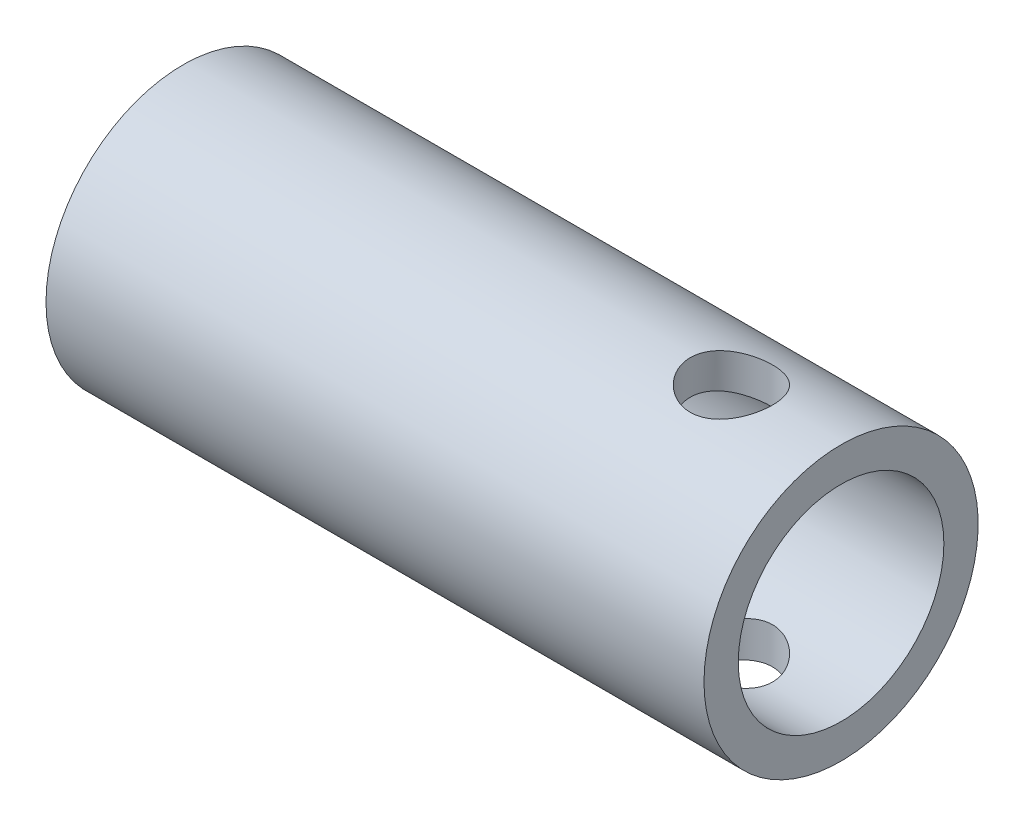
ISO-10303-21;
HEADER;
FILE_DESCRIPTION(('STEP AP214'),'2;1');
FILE_NAME('part.step','',(''),(''),'','','');
FILE_SCHEMA(('AUTOMOTIVE_DESIGN { 1 0 10303 214 1 1 1 1 }'));
ENDSEC;
DATA;
#1=APPLICATION_CONTEXT('core data for automotive mechanical design processes');
#2=APPLICATION_PROTOCOL_DEFINITION('international standard','automotive_design',2000,#1);
#3=PRODUCT_CONTEXT('',#1,'mechanical');
#4=PRODUCT('Part','Part','',(#3));
#5=PRODUCT_RELATED_PRODUCT_CATEGORY('part','',(#4));
#6=PRODUCT_DEFINITION_FORMATION('','',#4);
#7=PRODUCT_DEFINITION_CONTEXT('part definition',#1,'design');
#8=PRODUCT_DEFINITION('design','',#6,#7);
#9=PRODUCT_DEFINITION_SHAPE('','',#8);
#10=(LENGTH_UNIT() NAMED_UNIT(*) SI_UNIT(.MILLI.,.METRE.));
#11=(NAMED_UNIT(*) PLANE_ANGLE_UNIT() SI_UNIT($,.RADIAN.));
#12=(NAMED_UNIT(*) SI_UNIT($,.STERADIAN.) SOLID_ANGLE_UNIT());
#13=UNCERTAINTY_MEASURE_WITH_UNIT(LENGTH_MEASURE(1.E-05),#10,'distance_accuracy_value','');
#14=(GEOMETRIC_REPRESENTATION_CONTEXT(3) GLOBAL_UNCERTAINTY_ASSIGNED_CONTEXT((#13)) GLOBAL_UNIT_ASSIGNED_CONTEXT((#10,
#11,#12)) REPRESENTATION_CONTEXT('',''));
#15=CARTESIAN_POINT('',(0.,0.,0.));
#16=DIRECTION('',(0.,0.,1.));
#17=DIRECTION('',(1.,0.,0.));
#18=AXIS2_PLACEMENT_3D('',#15,#16,#17);
#19=CARTESIAN_POINT('',(-25.4,0.,31.75));
#20=DIRECTION('',(0.,1.,0.));
#21=DIRECTION('',(0.,0.,1.));
#22=AXIS2_PLACEMENT_3D('',#19,#20,#21);
#23=CYLINDRICAL_SURFACE('',#22,9.525);
#24=CARTESIAN_POINT('',(-25.4,9.92548325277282,41.275));
#25=CARTESIAN_POINT('',(-25.1447840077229,9.92548128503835,41.2749980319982));
#26=CARTESIAN_POINT('',(-24.8894900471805,9.92099147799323,41.2647285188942));
#27=CARTESIAN_POINT('',(-24.3807474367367,9.90317655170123,41.2237502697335));
#28=CARTESIAN_POINT('',(-24.1273000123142,9.88984602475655,41.1930290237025));
#29=CARTESIAN_POINT('',(-23.6237016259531,9.85475984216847,41.1113882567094));
#30=CARTESIAN_POINT('',(-23.3735590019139,9.8329859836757,41.0604250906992));
#31=CARTESIAN_POINT('',(-22.8789020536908,9.78172906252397,40.9388286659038));
#32=CARTESIAN_POINT('',(-22.6343881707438,9.75224539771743,40.8681938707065));
#33=CARTESIAN_POINT('',(-22.153550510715,9.68662654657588,40.7082443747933));
#34=CARTESIAN_POINT('',(-21.917198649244,9.65051759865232,40.6190031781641));
#35=CARTESIAN_POINT('',(-21.4531071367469,9.5726432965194,40.4224375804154));
#36=CARTESIAN_POINT('',(-21.2253677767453,9.5308777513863,40.3151125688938));
#37=CARTESIAN_POINT('',(-20.7798774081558,9.44288462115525,40.0832538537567));
#38=CARTESIAN_POINT('',(-20.5621216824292,9.39665917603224,39.9587283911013));
#39=CARTESIAN_POINT('',(-20.1375366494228,9.30094103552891,39.6932249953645));
#40=CARTESIAN_POINT('',(-19.9307113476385,9.25144715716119,39.552241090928));
#41=CARTESIAN_POINT('',(-19.5187098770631,9.14784706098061,39.2470081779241));
#42=CARTESIAN_POINT('',(-19.3141719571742,9.0936346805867,39.0819331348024));
#43=CARTESIAN_POINT('',(-18.9195353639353,8.98445610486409,38.7355662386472));
#44=CARTESIAN_POINT('',(-18.7294371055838,8.92948988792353,38.5542739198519));
#45=CARTESIAN_POINT('',(-18.3646662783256,8.82021254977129,38.1764062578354));
#46=CARTESIAN_POINT('',(-18.1900017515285,8.76590178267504,37.979823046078));
#47=CARTESIAN_POINT('',(-17.8573307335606,8.65938363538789,37.5726165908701));
#48=CARTESIAN_POINT('',(-17.6993185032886,8.60717553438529,37.3619982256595));
#49=CARTESIAN_POINT('',(-17.39496675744,8.50416670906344,36.919148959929));
#50=CARTESIAN_POINT('',(-17.2493457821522,8.45350553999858,36.6863907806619));
#51=CARTESIAN_POINT('',(-16.9784051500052,8.35733550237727,36.2084514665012));
#52=CARTESIAN_POINT('',(-16.8530771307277,8.31182451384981,35.9632755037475));
#53=CARTESIAN_POINT('',(-16.6237804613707,8.22724078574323,35.4620785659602));
#54=CARTESIAN_POINT('',(-16.5198098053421,8.18816744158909,35.2060586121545));
#55=CARTESIAN_POINT('',(-16.3342536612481,8.11760872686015,34.6850181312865));
#56=CARTESIAN_POINT('',(-16.2526667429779,8.08612287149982,34.4199981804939));
#57=CARTESIAN_POINT('',(-16.1161490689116,8.03300899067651,33.8960301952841));
#58=CARTESIAN_POINT('',(-16.0601191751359,8.01097756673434,33.6374092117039));
#59=CARTESIAN_POINT('',(-15.9697212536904,7.97526636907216,33.1158368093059));
#60=CARTESIAN_POINT('',(-15.9353525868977,7.96158634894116,32.8528855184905));
#61=CARTESIAN_POINT('',(-15.888666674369,7.94297300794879,32.3248078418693));
#62=CARTESIAN_POINT('',(-15.8763424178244,7.93803690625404,32.0596821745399));
#63=CARTESIAN_POINT('',(-15.8738654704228,7.93704624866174,31.5293150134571));
#64=CARTESIAN_POINT('',(-15.8837120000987,7.94099138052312,31.2640735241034));
#65=CARTESIAN_POINT('',(-15.9242841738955,7.95717743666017,30.7504933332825));
#66=CARTESIAN_POINT('',(-15.9538041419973,7.96893921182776,30.5020431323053));
#67=CARTESIAN_POINT('',(-16.0321890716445,7.99996595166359,30.0087013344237));
#68=CARTESIAN_POINT('',(-16.0810531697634,8.01923058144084,29.7638095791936));
#69=CARTESIAN_POINT('',(-16.1976619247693,8.06477929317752,29.2792289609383));
#70=CARTESIAN_POINT('',(-16.2654072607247,8.09106362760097,29.0395402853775));
#71=CARTESIAN_POINT('',(-16.4191707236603,8.15000452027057,28.5669051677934));
#72=CARTESIAN_POINT('',(-16.5051893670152,8.18266125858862,28.3339589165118));
#73=CARTESIAN_POINT('',(-16.6961924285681,8.25408889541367,27.8728147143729));
#74=CARTESIAN_POINT('',(-16.801439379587,8.29294334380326,27.6447385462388));
#75=CARTESIAN_POINT('',(-17.0292345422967,8.37548447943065,27.1982138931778));
#76=CARTESIAN_POINT('',(-17.151788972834,8.41917290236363,26.9797689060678));
#77=CARTESIAN_POINT('',(-17.41331549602,8.51034333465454,26.5537539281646));
#78=CARTESIAN_POINT('',(-17.5522888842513,8.55782564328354,26.3461847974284));
#79=CARTESIAN_POINT('',(-17.8457656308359,8.65548026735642,25.942991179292));
#80=CARTESIAN_POINT('',(-18.0002701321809,8.70565278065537,25.7473675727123));
#81=CARTESIAN_POINT('',(-18.3345450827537,8.81087633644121,25.3566171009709));
#82=CARTESIAN_POINT('',(-18.5153084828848,8.86603136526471,25.1623667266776));
#83=CARTESIAN_POINT('',(-18.89235845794,8.97662848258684,24.7896476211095));
#84=CARTESIAN_POINT('',(-19.0886456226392,9.03207058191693,24.611179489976));
#85=CARTESIAN_POINT('',(-19.495691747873,9.14177208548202,24.2710201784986));
#86=CARTESIAN_POINT('',(-19.706455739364,9.19603106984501,24.1093348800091));
#87=CARTESIAN_POINT('',(-20.1412043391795,9.3018370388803,23.8038517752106));
#88=CARTESIAN_POINT('',(-20.3651883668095,9.35338414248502,23.660053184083));
#89=CARTESIAN_POINT('',(-20.8317013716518,9.45368787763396,23.3875053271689));
#90=CARTESIAN_POINT('',(-21.074577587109,9.50232247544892,23.2593043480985));
#91=CARTESIAN_POINT('',(-21.5713319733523,9.59354127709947,23.0240377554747));
#92=CARTESIAN_POINT('',(-21.8252053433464,9.63612808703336,22.9169630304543));
#93=CARTESIAN_POINT('',(-22.3422252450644,9.71379714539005,22.7249429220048));
#94=CARTESIAN_POINT('',(-22.6053689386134,9.7488816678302,22.6399908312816));
#95=CARTESIAN_POINT('',(-23.1390023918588,9.81027734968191,22.4931063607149));
#96=CARTESIAN_POINT('',(-23.4094915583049,9.83658921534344,22.4311721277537));
#97=CARTESIAN_POINT('',(-23.9389015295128,9.87812284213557,22.3341222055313));
#98=CARTESIAN_POINT('',(-24.1975194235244,9.89392396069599,22.2975991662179));
#99=CARTESIAN_POINT('',(-24.7172759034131,9.91635045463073,22.2459110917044));
#100=CARTESIAN_POINT('',(-24.9784143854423,9.92297620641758,22.230745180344));
#101=CARTESIAN_POINT('',(-25.5010523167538,9.92681340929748,22.2219516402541));
#102=CARTESIAN_POINT('',(-25.7625516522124,9.92402735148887,22.2283183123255));
#103=CARTESIAN_POINT('',(-26.2838718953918,9.90914660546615,22.2625015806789));
#104=CARTESIAN_POINT('',(-26.5436928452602,9.89705215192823,22.2903176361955));
#105=CARTESIAN_POINT('',(-27.044829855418,9.86493497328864,22.3648724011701));
#106=CARTESIAN_POINT('',(-27.2863537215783,9.84540579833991,22.4104365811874));
#107=CARTESIAN_POINT('',(-27.7645776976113,9.79905244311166,22.5199085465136));
#108=CARTESIAN_POINT('',(-28.0012761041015,9.77222573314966,22.583822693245));
#109=CARTESIAN_POINT('',(-28.4682386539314,9.71207794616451,22.729393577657));
#110=CARTESIAN_POINT('',(-28.6985041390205,9.67875823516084,22.8110465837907));
#111=CARTESIAN_POINT('',(-29.1514201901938,9.60654332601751,22.9914658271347));
#112=CARTESIAN_POINT('',(-29.3740677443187,9.56764595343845,23.090238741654));
#113=CARTESIAN_POINT('',(-29.8192377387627,9.48366871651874,23.3084449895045));
#114=CARTESIAN_POINT('',(-30.0413967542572,9.43840341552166,23.4285482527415));
#115=CARTESIAN_POINT('',(-30.4750071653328,9.34418800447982,23.6856653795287));
#116=CARTESIAN_POINT('',(-30.6864537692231,9.29523626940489,23.8226867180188));
#117=CARTESIAN_POINT('',(-31.0974889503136,9.19493010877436,24.1127541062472));
#118=CARTESIAN_POINT('',(-31.2970759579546,9.14357536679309,24.2658022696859));
#119=CARTESIAN_POINT('',(-31.6833649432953,9.03974706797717,24.5870355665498));
#120=CARTESIAN_POINT('',(-31.8700664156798,8.98727346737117,24.7552212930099));
#121=CARTESIAN_POINT('',(-32.2429674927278,8.87858543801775,25.118848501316));
#122=CARTESIAN_POINT('',(-32.4281031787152,8.82238216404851,25.3153862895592));
#123=CARTESIAN_POINT('',(-32.7811792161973,8.711700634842,25.7236714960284));
#124=CARTESIAN_POINT('',(-32.9491254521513,8.65722179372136,25.9354136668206));
#125=CARTESIAN_POINT('',(-33.2668335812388,8.55141920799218,26.3730400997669));
#126=CARTESIAN_POINT('',(-33.416586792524,8.50009697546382,26.5989310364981));
#127=CARTESIAN_POINT('',(-33.6966222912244,8.40206063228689,27.0632994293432));
#128=CARTESIAN_POINT('',(-33.8269129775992,8.35534453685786,27.3017713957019));
#129=CARTESIAN_POINT('',(-34.0670073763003,8.267792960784,27.789876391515));
#130=CARTESIAN_POINT('',(-34.1768101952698,8.22695773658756,28.0395099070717));
#131=CARTESIAN_POINT('',(-34.374890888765,8.15233538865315,28.5482105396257));
#132=CARTESIAN_POINT('',(-34.4631685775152,8.11854832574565,28.8072777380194));
#133=CARTESIAN_POINT('',(-34.6172497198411,8.05902762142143,29.3327962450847));
#134=CARTESIAN_POINT('',(-34.6830632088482,8.03329038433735,29.5992441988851));
#135=CARTESIAN_POINT('',(-34.7915299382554,7.99062559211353,30.1375031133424));
#136=CARTESIAN_POINT('',(-34.8341847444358,7.9736974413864,30.4093137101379));
#137=CARTESIAN_POINT('',(-34.8938221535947,7.94996846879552,30.9381584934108));
#138=CARTESIAN_POINT('',(-34.9122990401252,7.9425786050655,31.1949987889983));
#139=CARTESIAN_POINT('',(-34.9283888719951,7.93614546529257,31.7094310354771));
#140=CARTESIAN_POINT('',(-34.9260027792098,7.93710180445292,31.9670229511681));
#141=CARTESIAN_POINT('',(-34.9003952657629,7.94733406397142,32.4809630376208));
#142=CARTESIAN_POINT('',(-34.877176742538,7.95660882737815,32.7373113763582));
#143=CARTESIAN_POINT('',(-34.8101554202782,7.9832246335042,33.2468753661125));
#144=CARTESIAN_POINT('',(-34.7663526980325,8.00056564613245,33.5000910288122));
#145=CARTESIAN_POINT('',(-34.6602848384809,8.04219309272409,33.9937713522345));
#146=CARTESIAN_POINT('',(-34.5986337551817,8.06624769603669,34.2343880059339));
#147=CARTESIAN_POINT('',(-34.4569641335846,8.12091071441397,34.7094751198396));
#148=CARTESIAN_POINT('',(-34.3769391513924,8.15152142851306,34.9439433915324));
#149=CARTESIAN_POINT('',(-34.1992193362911,8.21855245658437,35.4051944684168));
#150=CARTESIAN_POINT('',(-34.1015260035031,8.25497227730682,35.6319779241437));
#151=CARTESIAN_POINT('',(-33.889217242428,8.33277155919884,36.0766057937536));
#152=CARTESIAN_POINT('',(-33.7746004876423,8.37415140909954,36.2944495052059));
#153=CARTESIAN_POINT('',(-33.5238360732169,8.46283852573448,36.7294262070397));
#154=CARTESIAN_POINT('',(-33.3869611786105,8.51032684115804,36.9461030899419));
#155=CARTESIAN_POINT('',(-33.0965957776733,8.60851228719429,37.3672470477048));
#156=CARTESIAN_POINT('',(-32.9431048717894,8.65920949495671,37.5717138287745));
#157=CARTESIAN_POINT('',(-32.6204105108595,8.76260139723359,37.9674353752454));
#158=CARTESIAN_POINT('',(-32.4512012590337,8.81529682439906,38.1586852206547));
#159=CARTESIAN_POINT('',(-32.0980925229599,8.9213859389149,38.5268910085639));
#160=CARTESIAN_POINT('',(-31.9141928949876,8.97477963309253,38.7038468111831));
#161=CARTESIAN_POINT('',(-31.5208142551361,9.0842542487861,39.0530583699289));
#162=CARTESIAN_POINT('',(-31.3104556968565,9.14029576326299,39.2243372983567));
#163=CARTESIAN_POINT('',(-30.8755805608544,9.25006062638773,39.5485366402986));
#164=CARTESIAN_POINT('',(-30.6510687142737,9.30378473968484,39.7014631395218));
#165=CARTESIAN_POINT('',(-30.1890448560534,9.40735497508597,39.9879969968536));
#166=CARTESIAN_POINT('',(-29.9515275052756,9.45719948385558,40.1215963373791));
#167=CARTESIAN_POINT('',(-29.465060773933,9.55141125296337,40.3683096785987));
#168=CARTESIAN_POINT('',(-29.2161129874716,9.59577927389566,40.4814265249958));
#169=CARTESIAN_POINT('',(-28.731221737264,9.67389160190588,40.6769626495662));
#170=CARTESIAN_POINT('',(-28.496116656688,9.70823201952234,40.761225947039));
#171=CARTESIAN_POINT('',(-28.019207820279,9.77014762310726,40.9112137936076));
#172=CARTESIAN_POINT('',(-27.7774048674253,9.79772361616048,40.9769405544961));
#173=CARTESIAN_POINT('',(-27.2892463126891,9.84520811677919,41.0891087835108));
#174=CARTESIAN_POINT('',(-27.04290301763,9.86513485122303,41.135596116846));
#175=CARTESIAN_POINT('',(-26.5468981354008,9.89676830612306,41.2090187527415));
#176=CARTESIAN_POINT('',(-26.2972385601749,9.90847979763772,41.2359654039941));
#177=CARTESIAN_POINT('',(-25.9392336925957,9.91908841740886,41.2603365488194));
#178=CARTESIAN_POINT('',(-25.8314832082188,9.92148455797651,41.2658334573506));
#179=CARTESIAN_POINT('',(-25.6158264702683,9.92468245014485,41.2731657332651));
#180=CARTESIAN_POINT('',(-25.5079202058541,9.92548408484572,41.275000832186));
#181=CARTESIAN_POINT('',(-25.4,9.92548325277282,41.275));
#182=B_SPLINE_CURVE_WITH_KNOTS('',3,(#24,#25,#26,#27,#28,#29,#30,#31,#32,#33,#34,#35,#36,#37,
#38,#39,#40,#41,#42,#43,#44,#45,#46,#47,#48,#49,#50,#51,#52,#53,#54,#55,#56,#57,#58,#59,#60,#61,
#62,#63,#64,#65,#66,#67,#68,#69,#70,#71,#72,#73,#74,#75,#76,#77,#78,#79,#80,#81,#82,#83,#84,#85,
#86,#87,#88,#89,#90,#91,#92,#93,#94,#95,#96,#97,#98,#99,#100,#101,#102,#103,#104,#105,#106,#107,
#108,#109,#110,#111,#112,#113,#114,#115,#116,#117,#118,#119,#120,#121,#122,#123,#124,#125,#126,
#127,#128,#129,#130,#131,#132,#133,#134,#135,#136,#137,#138,#139,#140,#141,#142,#143,#144,#145,
#146,#147,#148,#149,#150,#151,#152,#153,#154,#155,#156,#157,#158,#159,#160,#161,#162,#163,#164,
#165,#166,#167,#168,#169,#170,#171,#172,#173,#174,#175,#176,#177,#178,#179,#180,#181),
.UNSPECIFIED.,.T.,.F.,(4,2,2,2,2,2,2,2,2,2,2,2,2,2,2,2,2,2,2,2,2,2,2,2,2,2,2,2,2,2,2,2,2,2,2,2,
2,2,2,2,2,2,2,2,2,2,2,2,2,2,2,2,2,2,2,2,2,2,2,2,2,2,2,2,2,2,2,2,2,2,2,2,2,2,2,2,2,2,4),(0.,
0.765538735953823,1.53154616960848,2.29921429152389,3.06694238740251,3.83169318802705,
4.59646980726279,5.36088127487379,6.12557094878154,6.929800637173,7.73405343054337,
8.53872285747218,9.34311404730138,10.1796415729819,11.0158234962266,11.8519268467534,
12.687976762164,13.483557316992,14.2791143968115,15.0744184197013,15.8696944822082,
16.6202337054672,17.3707394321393,18.1212721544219,18.8718260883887,19.6335193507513,
20.3954870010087,21.1575148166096,21.9195987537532,22.7317355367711,23.54390318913,
24.3563545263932,25.1687702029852,26.0044298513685,26.839728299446,27.6747732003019,
28.5097508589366,29.293713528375,30.077644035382,30.8613670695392,31.645070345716,
32.3839052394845,33.1229965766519,33.8619325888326,34.6011574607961,35.3700412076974,
36.139265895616,36.9085921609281,37.6779485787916,38.5043576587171,39.3304828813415,
40.1570008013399,40.983161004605,41.8093572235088,42.6355605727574,43.4613943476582,
44.2871722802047,45.0590362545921,45.8308646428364,46.6025856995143,47.374303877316,
48.1221124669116,48.8701837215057,49.6181914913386,50.3662579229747,51.1473553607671,
51.9284715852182,52.7098770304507,53.4912901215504,54.3213033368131,55.151040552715,
55.9811209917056,56.8110860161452,57.5665556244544,58.32193505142,59.0755031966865,
59.8286333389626,60.1523240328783,60.4760384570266),.UNSPECIFIED.);
#183=CARTESIAN_POINT('',(-25.4,9.92548325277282,41.275));
#184=VERTEX_POINT('',#183);
#185=EDGE_CURVE('E73',#184,#184,#182,.T.);
#186=ORIENTED_EDGE('',*,*,#185,.T.);
#187=EDGE_LOOP('',(#186));
#188=FACE_BOUND('',#187,.T.);
#189=CARTESIAN_POINT('',(-34.925,0.,31.75));
#190=CARTESIAN_POINT('',(-34.9249994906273,3.27487291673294E-07,32.0112762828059));
#191=CARTESIAN_POINT('',(-34.9142407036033,0.0032328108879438,32.2725615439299));
#192=CARTESIAN_POINT('',(-34.8713024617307,0.0160744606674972,32.7932132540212));
#193=CARTESIAN_POINT('',(-34.8391220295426,0.0256839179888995,33.0525796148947));
#194=CARTESIAN_POINT('',(-34.7536208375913,0.0510184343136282,33.5675671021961));
#195=CARTESIAN_POINT('',(-34.7002946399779,0.0667450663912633,33.8231872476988));
#196=CARTESIAN_POINT('',(-34.5729711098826,0.103885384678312,34.3287964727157));
#197=CARTESIAN_POINT('',(-34.4989739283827,0.125299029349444,34.5787855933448));
#198=CARTESIAN_POINT('',(-34.3310728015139,0.173197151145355,35.0710042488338));
#199=CARTESIAN_POINT('',(-34.2372027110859,0.199672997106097,35.3132461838));
#200=CARTESIAN_POINT('',(-34.0301879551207,0.257030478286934,35.7889089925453));
#201=CARTESIAN_POINT('',(-33.9170361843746,0.287913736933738,36.022326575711));
#202=CARTESIAN_POINT('',(-33.6723403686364,0.353270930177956,36.4787475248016));
#203=CARTESIAN_POINT('',(-33.5407983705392,0.387744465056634,36.7017520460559));
#204=CARTESIAN_POINT('',(-33.2602281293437,0.459399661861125,37.1360258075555));
#205=CARTESIAN_POINT('',(-33.1111989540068,0.496581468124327,37.3472944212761));
#206=CARTESIAN_POINT('',(-32.7925724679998,0.573686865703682,37.7621256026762));
#207=CARTESIAN_POINT('',(-32.6225430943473,0.613656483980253,37.9653478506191));
#208=CARTESIAN_POINT('',(-32.2662394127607,0.694372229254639,38.3568480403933));
#209=CARTESIAN_POINT('',(-32.0799648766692,0.735118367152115,38.5451257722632));
#210=CARTESIAN_POINT('',(-31.6923165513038,0.816293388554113,38.905587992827));
#211=CARTESIAN_POINT('',(-31.4909400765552,0.856722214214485,39.0777696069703));
#212=CARTESIAN_POINT('',(-31.0743749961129,0.936145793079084,39.4048824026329));
#213=CARTESIAN_POINT('',(-30.8591867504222,0.975140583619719,39.5598140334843));
#214=CARTESIAN_POINT('',(-30.4112813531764,1.05146534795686,39.8547024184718));
#215=CARTESIAN_POINT('',(-30.1782766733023,1.08873721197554,39.9942379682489));
#216=CARTESIAN_POINT('',(-29.7008466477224,1.15950379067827,40.2530609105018));
#217=CARTESIAN_POINT('',(-29.4564257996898,1.19299997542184,40.3723561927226));
#218=CARTESIAN_POINT('',(-28.9577494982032,1.25519279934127,40.589798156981));
#219=CARTESIAN_POINT('',(-28.7034938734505,1.28388935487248,40.6879444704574));
#220=CARTESIAN_POINT('',(-28.1869816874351,1.33556044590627,40.8622247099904));
#221=CARTESIAN_POINT('',(-27.9247254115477,1.35853518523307,40.9383594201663));
#222=CARTESIAN_POINT('',(-27.4016099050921,1.39745147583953,41.0660953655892));
#223=CARTESIAN_POINT('',(-27.1409170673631,1.41357190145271,41.1183236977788));
#224=CARTESIAN_POINT('',(-26.6157565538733,1.43917408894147,41.200830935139));
#225=CARTESIAN_POINT('',(-26.3512889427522,1.44865596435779,41.2311102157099));
#226=CARTESIAN_POINT('',(-25.8206452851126,1.46067063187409,41.2694238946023));
#227=CARTESIAN_POINT('',(-25.5544696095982,1.46320488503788,41.2774629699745));
#228=CARTESIAN_POINT('',(-25.0224086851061,1.46124490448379,41.2712303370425));
#229=CARTESIAN_POINT('',(-24.7565234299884,1.45675082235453,41.2569591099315));
#230=CARTESIAN_POINT('',(-24.236715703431,1.44117170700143,41.2071703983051));
#231=CARTESIAN_POINT('',(-23.9827096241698,1.43033211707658,41.1724438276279));
#232=CARTESIAN_POINT('',(-23.4785526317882,1.40258727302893,41.0826976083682));
#233=CARTESIAN_POINT('',(-23.2284031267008,1.38567985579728,41.027670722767));
#234=CARTESIAN_POINT('',(-22.7338338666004,1.34630675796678,40.8978156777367));
#235=CARTESIAN_POINT('',(-22.4894123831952,1.3238427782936,40.8229935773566));
#236=CARTESIAN_POINT('',(-22.0077250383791,1.27399324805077,40.6541147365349));
#237=CARTESIAN_POINT('',(-21.770461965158,1.24660580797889,40.5600506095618));
#238=CARTESIAN_POINT('',(-21.3015831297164,1.18729248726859,40.352049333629));
#239=CARTESIAN_POINT('',(-21.0700840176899,1.1553112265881,40.2378651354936));
#240=CARTESIAN_POINT('',(-20.6173863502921,1.08796917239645,39.9912802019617));
#241=CARTESIAN_POINT('',(-20.3961924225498,1.05260688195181,39.858871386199));
#242=CARTESIAN_POINT('',(-19.9655378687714,0.979474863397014,39.5767812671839));
#243=CARTESIAN_POINT('',(-19.756077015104,0.941705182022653,39.427100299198));
#244=CARTESIAN_POINT('',(-19.3501072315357,0.864755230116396,39.1114226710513));
#245=CARTESIAN_POINT('',(-19.1535986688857,0.825574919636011,38.9454255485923));
#246=CARTESIAN_POINT('',(-18.7667243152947,0.745162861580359,38.59083236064));
#247=CARTESIAN_POINT('',(-18.5769630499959,0.703914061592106,38.4015800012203));
#248=CARTESIAN_POINT('',(-18.2140509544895,0.62214293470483,38.0077503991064));
#249=CARTESIAN_POINT('',(-18.0408943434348,0.581620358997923,37.8031785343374));
#250=CARTESIAN_POINT('',(-17.7122016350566,0.50238152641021,37.3798510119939));
#251=CARTESIAN_POINT('',(-17.5566736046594,0.463666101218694,37.1610889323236));
#252=CARTESIAN_POINT('',(-17.2644908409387,0.389141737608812,36.7109559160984));
#253=CARTESIAN_POINT('',(-17.1278286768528,0.353331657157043,36.4795899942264));
#254=CARTESIAN_POINT('',(-16.8734546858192,0.285357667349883,36.0040408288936));
#255=CARTESIAN_POINT('',(-16.7558810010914,0.253220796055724,35.7597797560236));
#256=CARTESIAN_POINT('',(-16.5418012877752,0.193796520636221,35.2616147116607));
#257=CARTESIAN_POINT('',(-16.4452954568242,0.166509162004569,35.0077106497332));
#258=CARTESIAN_POINT('',(-16.2742125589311,0.117577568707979,34.4921484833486));
#259=CARTESIAN_POINT('',(-16.1996305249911,0.0959320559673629,34.2304921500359));
#260=CARTESIAN_POINT('',(-16.0730550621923,0.0589112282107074,33.7013382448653));
#261=CARTESIAN_POINT('',(-16.0210608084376,0.0435356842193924,33.4338408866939));
#262=CARTESIAN_POINT('',(-15.9416100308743,0.0199411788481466,32.9047547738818));
#263=CARTESIAN_POINT('',(-15.9133398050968,0.0114851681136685,32.6432985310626));
#264=CARTESIAN_POINT('',(-15.8785155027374,0.00105886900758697,32.1188169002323));
#265=CARTESIAN_POINT('',(-15.8719609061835,-0.000911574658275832,31.855791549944));
#266=CARTESIAN_POINT('',(-15.8806277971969,0.00168813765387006,31.3301656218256));
#267=CARTESIAN_POINT('',(-15.8958466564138,0.00625750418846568,31.0675649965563));
#268=CARTESIAN_POINT('',(-15.9479143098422,0.0218077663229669,30.5447110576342));
#269=CARTESIAN_POINT('',(-15.9847629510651,0.032788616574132,30.2844577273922));
#270=CARTESIAN_POINT('',(-16.0786679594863,0.0605357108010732,29.7741015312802));
#271=CARTESIAN_POINT('',(-16.1352440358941,0.0771642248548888,29.5239025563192));
#272=CARTESIAN_POINT('',(-16.2682750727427,0.115821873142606,29.0291801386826));
#273=CARTESIAN_POINT('',(-16.3447371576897,0.13785294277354,28.7846587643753));
#274=CARTESIAN_POINT('',(-16.5168906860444,0.186734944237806,28.3030636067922));
#275=CARTESIAN_POINT('',(-16.6125766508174,0.213584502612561,28.0659877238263));
#276=CARTESIAN_POINT('',(-16.822502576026,0.271433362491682,27.6006205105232));
#277=CARTESIAN_POINT('',(-16.9367496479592,0.302434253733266,27.3723325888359));
#278=CARTESIAN_POINT('',(-17.1857529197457,0.36854049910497,26.9209517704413));
#279=CARTESIAN_POINT('',(-17.3209160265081,0.403723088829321,26.6980946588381));
#280=CARTESIAN_POINT('',(-17.6088795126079,0.476704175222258,26.2643956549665));
#281=CARTESIAN_POINT('',(-17.7616878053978,0.514503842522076,26.0535592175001));
#282=CARTESIAN_POINT('',(-18.0838802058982,0.591726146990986,25.6452771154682));
#283=CARTESIAN_POINT('',(-18.2532642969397,0.631148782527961,25.447831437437));
#284=CARTESIAN_POINT('',(-18.6075408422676,0.710596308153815,25.0675104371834));
#285=CARTESIAN_POINT('',(-18.7924335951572,0.750621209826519,24.8846353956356));
#286=CARTESIAN_POINT('',(-19.1836322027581,0.831685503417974,24.5281611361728));
#287=CARTESIAN_POINT('',(-19.3904738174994,0.872708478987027,24.3551455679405));
#288=CARTESIAN_POINT('',(-19.818203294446,0.953097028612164,24.027191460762));
#289=CARTESIAN_POINT('',(-20.0390860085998,0.992463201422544,23.8722463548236));
#290=CARTESIAN_POINT('',(-20.4936357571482,1.06842464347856,23.5813989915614));
#291=CARTESIAN_POINT('',(-20.7273077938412,1.10501881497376,23.4455042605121));
#292=CARTESIAN_POINT('',(-21.2057183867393,1.17430882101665,23.1939122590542));
#293=CARTESIAN_POINT('',(-21.4504523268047,1.20700626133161,23.0782066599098));
#294=CARTESIAN_POINT('',(-21.9482851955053,1.26737465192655,22.8683374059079));
#295=CARTESIAN_POINT('',(-22.2013417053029,1.29506747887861,22.7740795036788));
#296=CARTESIAN_POINT('',(-22.7150631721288,1.34473048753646,22.6072613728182));
#297=CARTESIAN_POINT('',(-22.9757281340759,1.3667006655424,22.534701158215));
#298=CARTESIAN_POINT('',(-23.5026567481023,1.40419710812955,22.4119664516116));
#299=CARTESIAN_POINT('',(-23.7689187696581,1.4197252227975,22.3617855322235));
#300=CARTESIAN_POINT('',(-24.305056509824,1.44382772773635,22.2842682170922));
#301=CARTESIAN_POINT('',(-24.5749320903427,1.4524023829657,22.2569309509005));
#302=CARTESIAN_POINT('',(-25.1048673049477,1.46210246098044,22.2260299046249));
#303=CARTESIAN_POINT('',(-25.3648669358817,1.46352362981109,22.2215222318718));
#304=CARTESIAN_POINT('',(-25.8843098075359,1.45967173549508,22.2337740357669));
#305=CARTESIAN_POINT('',(-26.1437530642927,1.4543988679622,22.2505328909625));
#306=CARTESIAN_POINT('',(-26.6601746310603,1.43732425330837,22.3051599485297));
#307=CARTESIAN_POINT('',(-26.9171530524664,1.4255228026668,22.3430271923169));
#308=CARTESIAN_POINT('',(-27.4268152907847,1.39575595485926,22.439526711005));
#309=CARTESIAN_POINT('',(-27.6794990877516,1.37779052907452,22.4981590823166));
#310=CARTESIAN_POINT('',(-28.1756520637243,1.33650355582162,22.6348063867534));
#311=CARTESIAN_POINT('',(-28.4191973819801,1.3132526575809,22.7125666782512));
#312=CARTESIAN_POINT('',(-28.8988915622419,1.26193315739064,22.8872373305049));
#313=CARTESIAN_POINT('',(-29.1350377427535,1.23386283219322,22.984154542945));
#314=CARTESIAN_POINT('',(-29.5983588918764,1.17369669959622,23.1963847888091));
#315=CARTESIAN_POINT('',(-29.8255343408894,1.1416011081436,23.3116968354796));
#316=CARTESIAN_POINT('',(-30.2695808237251,1.07425195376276,23.5599137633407));
#317=CARTESIAN_POINT('',(-30.4864512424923,1.03899820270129,23.6928196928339));
#318=CARTESIAN_POINT('',(-30.9163129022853,0.964936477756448,23.9804946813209));
#319=CARTESIAN_POINT('',(-31.1288751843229,0.926045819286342,24.1358837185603));
#320=CARTESIAN_POINT('',(-31.5402681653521,0.846941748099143,24.4635815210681));
#321=CARTESIAN_POINT('',(-31.7390985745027,0.80672830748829,24.635890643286));
#322=CARTESIAN_POINT('',(-32.1218564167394,0.726054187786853,24.9963786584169));
#323=CARTESIAN_POINT('',(-32.3057800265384,0.685593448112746,25.1845615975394));
#324=CARTESIAN_POINT('',(-32.6575097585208,0.605514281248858,25.5755905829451));
#325=CARTESIAN_POINT('',(-32.8253161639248,0.565895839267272,25.7784363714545));
#326=CARTESIAN_POINT('',(-33.1484237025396,0.487408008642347,26.2037435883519));
#327=CARTESIAN_POINT('',(-33.3032097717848,0.448595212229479,26.4266071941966));
#328=CARTESIAN_POINT('',(-33.5933597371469,0.374079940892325,26.8850195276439));
#329=CARTESIAN_POINT('',(-33.728730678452,0.338376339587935,27.1205636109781));
#330=CARTESIAN_POINT('',(-33.9790405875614,0.271082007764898,27.6027758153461));
#331=CARTESIAN_POINT('',(-34.0939836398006,0.239490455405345,27.8494417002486));
#332=CARTESIAN_POINT('',(-34.3025077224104,0.181321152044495,28.3522028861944));
#333=CARTESIAN_POINT('',(-34.3960908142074,0.154742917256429,28.6082972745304));
#334=CARTESIAN_POINT('',(-34.5522134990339,0.109915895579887,29.1001222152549));
#335=CARTESIAN_POINT('',(-34.6170075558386,0.0910791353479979,29.3350863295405));
#336=CARTESIAN_POINT('',(-34.7284693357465,0.0584495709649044,29.8097113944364));
#337=CARTESIAN_POINT('',(-34.7751311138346,0.0446584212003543,30.0493738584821));
#338=CARTESIAN_POINT('',(-34.8499290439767,0.0224605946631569,30.5317890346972));
#339=CARTESIAN_POINT('',(-34.8780675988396,0.0140532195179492,30.7745413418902));
#340=CARTESIAN_POINT('',(-34.9155998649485,0.00282379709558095,31.2615268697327));
#341=CARTESIAN_POINT('',(-34.9250004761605,-3.06134391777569E-07,31.5057595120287));
#342=CARTESIAN_POINT('',(-34.925,0.,31.75));
#343=B_SPLINE_CURVE_WITH_KNOTS('',3,(#189,#190,#191,#192,#193,#194,#195,#196,#197,#198,#199,
#200,#201,#202,#203,#204,#205,#206,#207,#208,#209,#210,#211,#212,#213,#214,#215,#216,#217,#218,
#219,#220,#221,#222,#223,#224,#225,#226,#227,#228,#229,#230,#231,#232,#233,#234,#235,#236,#237,
#238,#239,#240,#241,#242,#243,#244,#245,#246,#247,#248,#249,#250,#251,#252,#253,#254,#255,#256,
#257,#258,#259,#260,#261,#262,#263,#264,#265,#266,#267,#268,#269,#270,#271,#272,#273,#274,#275,
#276,#277,#278,#279,#280,#281,#282,#283,#284,#285,#286,#287,#288,#289,#290,#291,#292,#293,#294,
#295,#296,#297,#298,#299,#300,#301,#302,#303,#304,#305,#306,#307,#308,#309,#310,#311,#312,#313,
#314,#315,#316,#317,#318,#319,#320,#321,#322,#323,#324,#325,#326,#327,#328,#329,#330,#331,#332,
#333,#334,#335,#336,#337,#338,#339,#340,#341,#342),.UNSPECIFIED.,.T.,.F.,(4,2,2,2,2,2,2,2,2,2,2,
2,2,2,2,2,2,2,2,2,2,2,2,2,2,2,2,2,2,2,2,2,2,2,2,2,2,2,2,2,2,2,2,2,2,2,2,2,2,2,2,2,2,2,2,2,2,2,2,
2,2,2,2,2,2,2,2,2,2,2,2,2,2,2,2,2,4),(0.,0.783603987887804,1.56724372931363,2.35108512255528,
3.13492079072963,3.91743173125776,4.70023164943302,5.48294450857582,6.26569911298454,
7.0686855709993,7.87168330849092,8.67482417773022,9.47794412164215,10.2993474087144,
11.1204297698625,11.941526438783,12.7625938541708,13.5606774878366,14.3587474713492,
15.156649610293,15.9545345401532,16.7234251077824,17.4925900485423,18.2615198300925,
19.0307453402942,19.8101739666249,20.5899492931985,21.3697094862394,22.1494917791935,
22.9620210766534,23.7742664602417,24.5868820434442,25.3991766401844,26.2171103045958,
27.0350516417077,27.8528075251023,28.6705335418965,29.4589107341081,30.247269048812,
31.0355322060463,31.8237897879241,32.5940607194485,33.364607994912,34.1349359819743,
34.90555981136,35.6936878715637,36.482170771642,37.2706528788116,38.0591501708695,
38.876478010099,39.6935078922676,40.5108596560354,41.3278734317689,42.1412245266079,
42.9545761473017,43.7676940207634,44.5807809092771,45.3599592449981,46.139114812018,
46.9182349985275,47.6973588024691,48.4666240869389,49.2361650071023,50.0056646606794,
50.7752101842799,51.5727832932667,52.3703732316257,53.1681670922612,53.9659469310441,
54.7872657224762,55.6082857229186,56.4291413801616,57.2499177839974,57.9825540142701,
58.7154302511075,59.4482114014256,60.1807226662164),.UNSPECIFIED.);
#344=CARTESIAN_POINT('',(-34.925,0.,31.75));
#345=VERTEX_POINT('',#344);
#346=EDGE_CURVE('E11',#345,#345,#343,.T.);
#347=ORIENTED_EDGE('',*,*,#346,.F.);
#348=EDGE_LOOP('',(#347));
#349=FACE_BOUND('',#348,.T.);
#350=ADVANCED_FACE('F29',(#188,#349),#23,.F.);
#351=CARTESIAN_POINT('',(-25.4,53.5745167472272,41.275));
#352=CARTESIAN_POINT('',(-25.6552159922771,53.5745187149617,41.2749980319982));
#353=CARTESIAN_POINT('',(-25.9105099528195,53.5790085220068,41.2647285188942));
#354=CARTESIAN_POINT('',(-26.4192525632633,53.5968234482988,41.2237502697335));
#355=CARTESIAN_POINT('',(-26.6726999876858,53.6101539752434,41.1930290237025));
#356=CARTESIAN_POINT('',(-27.1762983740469,53.6452401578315,41.1113882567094));
#357=CARTESIAN_POINT('',(-27.4264409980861,53.6670140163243,41.0604250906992));
#358=CARTESIAN_POINT('',(-27.9210979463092,53.718270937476,40.9388286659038));
#359=CARTESIAN_POINT('',(-28.1656118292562,53.7477546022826,40.8681938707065));
#360=CARTESIAN_POINT('',(-28.646449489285,53.8133734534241,40.7082443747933));
#361=CARTESIAN_POINT('',(-28.882801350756,53.8494824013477,40.6190031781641));
#362=CARTESIAN_POINT('',(-29.3468928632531,53.9273567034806,40.4224375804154));
#363=CARTESIAN_POINT('',(-29.5746322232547,53.9691222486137,40.3151125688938));
#364=CARTESIAN_POINT('',(-30.0201225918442,54.0571153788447,40.0832538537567));
#365=CARTESIAN_POINT('',(-30.2378783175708,54.1033408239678,39.9587283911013));
#366=CARTESIAN_POINT('',(-30.6624633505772,54.1990589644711,39.6932249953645));
#367=CARTESIAN_POINT('',(-30.8692886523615,54.2485528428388,39.552241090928));
#368=CARTESIAN_POINT('',(-31.2812901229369,54.3521529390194,39.2470081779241));
#369=CARTESIAN_POINT('',(-31.4858280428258,54.4063653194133,39.0819331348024));
#370=CARTESIAN_POINT('',(-31.8804646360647,54.5155438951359,38.7355662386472));
#371=CARTESIAN_POINT('',(-32.0705628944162,54.5705101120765,38.5542739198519));
#372=CARTESIAN_POINT('',(-32.4353337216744,54.6797874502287,38.1764062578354));
#373=CARTESIAN_POINT('',(-32.6099982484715,54.734098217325,37.979823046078));
#374=CARTESIAN_POINT('',(-32.9426692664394,54.8406163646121,37.5726165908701));
#375=CARTESIAN_POINT('',(-33.1006814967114,54.8928244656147,37.3619982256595));
#376=CARTESIAN_POINT('',(-33.40503324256,54.9958332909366,36.919148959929));
#377=CARTESIAN_POINT('',(-33.5506542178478,55.0464944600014,36.6863907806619));
#378=CARTESIAN_POINT('',(-33.8215948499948,55.1426644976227,36.2084514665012));
#379=CARTESIAN_POINT('',(-33.9469228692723,55.1881754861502,35.9632755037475));
#380=CARTESIAN_POINT('',(-34.1762195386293,55.2727592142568,35.4620785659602));
#381=CARTESIAN_POINT('',(-34.2801901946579,55.3118325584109,35.2060586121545));
#382=CARTESIAN_POINT('',(-34.4657463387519,55.3823912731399,34.6850181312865));
#383=CARTESIAN_POINT('',(-34.547333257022,55.4138771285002,34.4199981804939));
#384=CARTESIAN_POINT('',(-34.6838509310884,55.4669910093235,33.8960301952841));
#385=CARTESIAN_POINT('',(-34.7398808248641,55.4890224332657,33.6374092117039));
#386=CARTESIAN_POINT('',(-34.8302787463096,55.5247336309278,33.1158368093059));
#387=CARTESIAN_POINT('',(-34.8646474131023,55.5384136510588,32.8528855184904));
#388=CARTESIAN_POINT('',(-34.911333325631,55.5570269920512,32.3248078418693));
#389=CARTESIAN_POINT('',(-34.9236575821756,55.561963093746,32.0596821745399));
#390=CARTESIAN_POINT('',(-34.9261345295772,55.5629537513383,31.5293150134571));
#391=CARTESIAN_POINT('',(-34.9162879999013,55.5590086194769,31.2640735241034));
#392=CARTESIAN_POINT('',(-34.8757158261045,55.5428225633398,30.7504933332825));
#393=CARTESIAN_POINT('',(-34.8461958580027,55.5310607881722,30.5020431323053));
#394=CARTESIAN_POINT('',(-34.7678109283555,55.5000340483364,30.0087013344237));
#395=CARTESIAN_POINT('',(-34.7189468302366,55.4807694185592,29.7638095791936));
#396=CARTESIAN_POINT('',(-34.6023380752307,55.4352207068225,29.2792289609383));
#397=CARTESIAN_POINT('',(-34.5345927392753,55.408936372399,29.0395402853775));
#398=CARTESIAN_POINT('',(-34.3808292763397,55.3499954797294,28.5669051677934));
#399=CARTESIAN_POINT('',(-34.2948106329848,55.3173387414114,28.3339589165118));
#400=CARTESIAN_POINT('',(-34.1038075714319,55.2459111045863,27.8728147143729));
#401=CARTESIAN_POINT('',(-33.998560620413,55.2070566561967,27.6447385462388));
#402=CARTESIAN_POINT('',(-33.7707654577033,55.1245155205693,27.1982138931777));
#403=CARTESIAN_POINT('',(-33.648211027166,55.0808270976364,26.9797689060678));
#404=CARTESIAN_POINT('',(-33.38668450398,54.9896566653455,26.5537539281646));
#405=CARTESIAN_POINT('',(-33.2477111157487,54.9421743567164,26.3461847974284));
#406=CARTESIAN_POINT('',(-32.9542343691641,54.8445197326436,25.942991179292));
#407=CARTESIAN_POINT('',(-32.7997298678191,54.7943472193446,25.7473675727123));
#408=CARTESIAN_POINT('',(-32.4654549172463,54.6891236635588,25.3566171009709));
#409=CARTESIAN_POINT('',(-32.2846915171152,54.6339686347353,25.1623667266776));
#410=CARTESIAN_POINT('',(-31.90764154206,54.5233715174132,24.7896476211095));
#411=CARTESIAN_POINT('',(-31.7113543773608,54.4679294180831,24.611179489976));
#412=CARTESIAN_POINT('',(-31.304308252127,54.358227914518,24.2710201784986));
#413=CARTESIAN_POINT('',(-31.093544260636,54.303968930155,24.1093348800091));
#414=CARTESIAN_POINT('',(-30.6587956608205,54.1981629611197,23.8038517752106));
#415=CARTESIAN_POINT('',(-30.4348116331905,54.146615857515,23.660053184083));
#416=CARTESIAN_POINT('',(-29.9682986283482,54.046312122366,23.3875053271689));
#417=CARTESIAN_POINT('',(-29.725422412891,53.9976775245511,23.2593043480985));
#418=CARTESIAN_POINT('',(-29.2286680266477,53.9064587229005,23.0240377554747));
#419=CARTESIAN_POINT('',(-28.9747946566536,53.8638719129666,22.9169630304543));
#420=CARTESIAN_POINT('',(-28.4577747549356,53.78620285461,22.7249429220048));
#421=CARTESIAN_POINT('',(-28.1946310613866,53.7511183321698,22.6399908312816));
#422=CARTESIAN_POINT('',(-27.6609976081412,53.6897226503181,22.4931063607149));
#423=CARTESIAN_POINT('',(-27.3905084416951,53.6634107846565,22.4311721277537));
#424=CARTESIAN_POINT('',(-26.8610984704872,53.6218771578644,22.3341222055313));
#425=CARTESIAN_POINT('',(-26.6024805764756,53.606076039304,22.2975991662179));
#426=CARTESIAN_POINT('',(-26.0827240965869,53.5836495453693,22.2459110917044));
#427=CARTESIAN_POINT('',(-25.8215856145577,53.5770237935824,22.230745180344));
#428=CARTESIAN_POINT('',(-25.2989476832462,53.5731865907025,22.2219516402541));
#429=CARTESIAN_POINT('',(-25.0374483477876,53.5759726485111,22.2283183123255));
#430=CARTESIAN_POINT('',(-24.5161281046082,53.5908533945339,22.2625015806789));
#431=CARTESIAN_POINT('',(-24.2563071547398,53.6029478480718,22.2903176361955));
#432=CARTESIAN_POINT('',(-23.755170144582,53.6350650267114,22.3648724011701));
#433=CARTESIAN_POINT('',(-23.5136462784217,53.6545942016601,22.4104365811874));
#434=CARTESIAN_POINT('',(-23.0354223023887,53.7009475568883,22.5199085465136));
#435=CARTESIAN_POINT('',(-22.7987238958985,53.7277742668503,22.583822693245));
#436=CARTESIAN_POINT('',(-22.3317613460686,53.7879220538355,22.729393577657));
#437=CARTESIAN_POINT('',(-22.1014958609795,53.8212417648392,22.8110465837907));
#438=CARTESIAN_POINT('',(-21.6485798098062,53.8934566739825,22.9914658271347));
#439=CARTESIAN_POINT('',(-21.4259322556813,53.9323540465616,23.090238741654));
#440=CARTESIAN_POINT('',(-20.9807622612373,54.0163312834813,23.3084449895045));
#441=CARTESIAN_POINT('',(-20.7586032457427,54.0615965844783,23.4285482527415));
#442=CARTESIAN_POINT('',(-20.3249928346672,54.1558119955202,23.6856653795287));
#443=CARTESIAN_POINT('',(-20.1135462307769,54.2047637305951,23.8226867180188));
#444=CARTESIAN_POINT('',(-19.7025110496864,54.3050698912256,24.1127541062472));
#445=CARTESIAN_POINT('',(-19.5029240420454,54.3564246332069,24.2658022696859));
#446=CARTESIAN_POINT('',(-19.1166350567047,54.4602529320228,24.5870355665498));
#447=CARTESIAN_POINT('',(-18.9299335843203,54.5127265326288,24.7552212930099));
#448=CARTESIAN_POINT('',(-18.5570325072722,54.6214145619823,25.118848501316));
#449=CARTESIAN_POINT('',(-18.3718968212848,54.6776178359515,25.3153862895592));
#450=CARTESIAN_POINT('',(-18.0188207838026,54.788299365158,25.7236714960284));
#451=CARTESIAN_POINT('',(-17.8508745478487,54.8427782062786,25.9354136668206));
#452=CARTESIAN_POINT('',(-17.5331664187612,54.9485807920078,26.3730400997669));
#453=CARTESIAN_POINT('',(-17.383413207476,54.9999030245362,26.5989310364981));
#454=CARTESIAN_POINT('',(-17.1033777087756,55.0979393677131,27.0632994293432));
#455=CARTESIAN_POINT('',(-16.9730870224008,55.1446554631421,27.3017713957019));
#456=CARTESIAN_POINT('',(-16.7329926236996,55.232207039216,27.789876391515));
#457=CARTESIAN_POINT('',(-16.6231898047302,55.2730422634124,28.0395099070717));
#458=CARTESIAN_POINT('',(-16.425109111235,55.3476646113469,28.5482105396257));
#459=CARTESIAN_POINT('',(-16.3368314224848,55.3814516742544,28.8072777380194));
#460=CARTESIAN_POINT('',(-16.1827502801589,55.4409723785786,29.3327962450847));
#461=CARTESIAN_POINT('',(-16.1169367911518,55.4667096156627,29.5992441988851));
#462=CARTESIAN_POINT('',(-16.0084700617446,55.5093744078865,30.1375031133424));
#463=CARTESIAN_POINT('',(-15.9658152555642,55.5263025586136,30.4093137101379));
#464=CARTESIAN_POINT('',(-15.9061778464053,55.5500315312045,30.9381584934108));
#465=CARTESIAN_POINT('',(-15.8877009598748,55.5574213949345,31.1949987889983));
#466=CARTESIAN_POINT('',(-15.8716111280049,55.5638545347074,31.7094310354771));
#467=CARTESIAN_POINT('',(-15.8739972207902,55.5628981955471,31.9670229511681));
#468=CARTESIAN_POINT('',(-15.8996047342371,55.5526659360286,32.4809630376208));
#469=CARTESIAN_POINT('',(-15.922823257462,55.5433911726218,32.7373113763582));
#470=CARTESIAN_POINT('',(-15.9898445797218,55.5167753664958,33.2468753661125));
#471=CARTESIAN_POINT('',(-16.0336473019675,55.4994343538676,33.5000910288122));
#472=CARTESIAN_POINT('',(-16.1397151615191,55.4578069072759,33.9937713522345));
#473=CARTESIAN_POINT('',(-16.2013662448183,55.4337523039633,34.2343880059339));
#474=CARTESIAN_POINT('',(-16.3430358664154,55.379089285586,34.7094751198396));
#475=CARTESIAN_POINT('',(-16.4230608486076,55.348478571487,34.9439433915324));
#476=CARTESIAN_POINT('',(-16.6007806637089,55.2814475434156,35.4051944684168));
#477=CARTESIAN_POINT('',(-16.6984739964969,55.2450277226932,35.6319779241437));
#478=CARTESIAN_POINT('',(-16.910782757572,55.1672284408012,36.0766057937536));
#479=CARTESIAN_POINT('',(-17.0253995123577,55.1258485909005,36.2944495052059));
#480=CARTESIAN_POINT('',(-17.276163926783,55.0371614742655,36.7294262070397));
#481=CARTESIAN_POINT('',(-17.4130388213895,54.989673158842,36.9461030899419));
#482=CARTESIAN_POINT('',(-17.7034042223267,54.8914877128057,37.3672470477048));
#483=CARTESIAN_POINT('',(-17.8568951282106,54.8407905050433,37.5717138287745));
#484=CARTESIAN_POINT('',(-18.1795894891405,54.7373986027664,37.9674353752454));
#485=CARTESIAN_POINT('',(-18.3487987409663,54.6847031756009,38.1586852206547));
#486=CARTESIAN_POINT('',(-18.7019074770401,54.5786140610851,38.5268910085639));
#487=CARTESIAN_POINT('',(-18.8858071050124,54.5252203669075,38.7038468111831));
#488=CARTESIAN_POINT('',(-19.2791857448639,54.4157457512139,39.0530583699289));
#489=CARTESIAN_POINT('',(-19.4895443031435,54.359704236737,39.2243372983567));
#490=CARTESIAN_POINT('',(-19.9244194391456,54.2499393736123,39.5485366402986));
#491=CARTESIAN_POINT('',(-20.1489312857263,54.1962152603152,39.7014631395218));
#492=CARTESIAN_POINT('',(-20.6109551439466,54.092645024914,39.9879969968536));
#493=CARTESIAN_POINT('',(-20.8484724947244,54.0428005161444,40.1215963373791));
#494=CARTESIAN_POINT('',(-21.334939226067,53.9485887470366,40.3683096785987));
#495=CARTESIAN_POINT('',(-21.5838870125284,53.9042207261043,40.4814265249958));
#496=CARTESIAN_POINT('',(-22.068778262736,53.8261083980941,40.6769626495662));
#497=CARTESIAN_POINT('',(-22.303883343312,53.7917679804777,40.761225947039));
#498=CARTESIAN_POINT('',(-22.780792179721,53.7298523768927,40.9112137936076));
#499=CARTESIAN_POINT('',(-23.0225951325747,53.7022763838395,40.9769405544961));
#500=CARTESIAN_POINT('',(-23.5107536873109,53.6547918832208,41.0891087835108));
#501=CARTESIAN_POINT('',(-23.75709698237,53.634865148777,41.135596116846));
#502=CARTESIAN_POINT('',(-24.2531018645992,53.6032316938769,41.2090187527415));
#503=CARTESIAN_POINT('',(-24.5027614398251,53.5915202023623,41.2359654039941));
#504=CARTESIAN_POINT('',(-24.8607663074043,53.5809115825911,41.2603365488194));
#505=CARTESIAN_POINT('',(-24.9685167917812,53.5785154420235,41.2658334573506));
#506=CARTESIAN_POINT('',(-25.1841735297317,53.5753175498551,41.2731657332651));
#507=CARTESIAN_POINT('',(-25.2920797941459,53.5745159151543,41.275000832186));
#508=CARTESIAN_POINT('',(-25.4,53.5745167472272,41.275));
#509=B_SPLINE_CURVE_WITH_KNOTS('',3,(#351,#352,#353,#354,#355,#356,#357,#358,#359,#360,#361,
#362,#363,#364,#365,#366,#367,#368,#369,#370,#371,#372,#373,#374,#375,#376,#377,#378,#379,#380,
#381,#382,#383,#384,#385,#386,#387,#388,#389,#390,#391,#392,#393,#394,#395,#396,#397,#398,#399,
#400,#401,#402,#403,#404,#405,#406,#407,#408,#409,#410,#411,#412,#413,#414,#415,#416,#417,#418,
#419,#420,#421,#422,#423,#424,#425,#426,#427,#428,#429,#430,#431,#432,#433,#434,#435,#436,#437,
#438,#439,#440,#441,#442,#443,#444,#445,#446,#447,#448,#449,#450,#451,#452,#453,#454,#455,#456,
#457,#458,#459,#460,#461,#462,#463,#464,#465,#466,#467,#468,#469,#470,#471,#472,#473,#474,#475,
#476,#477,#478,#479,#480,#481,#482,#483,#484,#485,#486,#487,#488,#489,#490,#491,#492,#493,#494,
#495,#496,#497,#498,#499,#500,#501,#502,#503,#504,#505,#506,#507,#508),.UNSPECIFIED.,.T.,.F.,(4,
2,2,2,2,2,2,2,2,2,2,2,2,2,2,2,2,2,2,2,2,2,2,2,2,2,2,2,2,2,2,2,2,2,2,2,2,2,2,2,2,2,2,2,2,2,2,2,2,
2,2,2,2,2,2,2,2,2,2,2,2,2,2,2,2,2,2,2,2,2,2,2,2,2,2,2,2,2,4),(0.,0.765538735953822,
1.53154616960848,2.29921429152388,3.06694238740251,3.83169318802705,4.59646980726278,
5.36088127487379,6.12557094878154,6.92980063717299,7.73405343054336,8.53872285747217,
9.34311404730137,10.1796415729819,11.0158234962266,11.8519268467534,12.687976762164,
13.483557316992,14.2791143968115,15.0744184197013,15.8696944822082,16.6202337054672,
17.3707394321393,18.1212721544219,18.8718260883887,19.6335193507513,20.3954870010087,
21.1575148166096,21.9195987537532,22.7317355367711,23.54390318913,24.3563545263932,
25.1687702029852,26.0044298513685,26.839728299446,27.6747732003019,28.5097508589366,
29.293713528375,30.077644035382,30.8613670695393,31.645070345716,32.3839052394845,
33.1229965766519,33.8619325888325,34.6011574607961,35.3700412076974,36.139265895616,
36.9085921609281,37.6779485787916,38.5043576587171,39.3304828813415,40.1570008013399,
40.983161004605,41.8093572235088,42.6355605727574,43.4613943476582,44.2871722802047,
45.0590362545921,45.8308646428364,46.6025856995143,47.374303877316,48.1221124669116,
48.8701837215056,49.6181914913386,50.3662579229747,51.1473553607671,51.9284715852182,
52.7098770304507,53.4912901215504,54.3213033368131,55.151040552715,55.9811209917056,
56.8110860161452,57.5665556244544,58.32193505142,59.0755031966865,59.8286333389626,
60.1523240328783,60.4760384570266),.UNSPECIFIED.);
#510=CARTESIAN_POINT('',(-25.4,53.5745167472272,41.275));
#511=VERTEX_POINT('',#510);
#512=EDGE_CURVE('E68',#511,#511,#509,.T.);
#513=ORIENTED_EDGE('',*,*,#512,.T.);
#514=EDGE_LOOP('',(#513));
#515=FACE_BOUND('',#514,.T.);
#516=CARTESIAN_POINT('',(-25.4,62.037569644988,41.275));
#517=CARTESIAN_POINT('',(-25.6609779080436,62.0375700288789,41.2749994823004));
#518=CARTESIAN_POINT('',(-25.9219648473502,62.040951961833,41.2642650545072));
#519=CARTESIAN_POINT('',(-26.4420113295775,62.0543739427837,41.2214263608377));
#520=CARTESIAN_POINT('',(-26.701070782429,62.0644142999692,41.1893211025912));
#521=CARTESIAN_POINT('',(-27.2154399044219,62.0908421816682,41.1040250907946));
#522=CARTESIAN_POINT('',(-27.4707484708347,62.107231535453,41.0508282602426));
#523=CARTESIAN_POINT('',(-27.9757266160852,62.1458525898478,40.923823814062));
#524=CARTESIAN_POINT('',(-28.2253962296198,62.1680842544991,40.8500163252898));
#525=CARTESIAN_POINT('',(-28.7169340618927,62.2176753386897,40.6825730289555));
#526=CARTESIAN_POINT('',(-28.9588160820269,62.245025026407,40.5889748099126));
#527=CARTESIAN_POINT('',(-29.4337873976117,62.3040955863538,40.3825698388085));
#528=CARTESIAN_POINT('',(-29.6668734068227,62.3358180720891,40.2697559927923));
#529=CARTESIAN_POINT('',(-30.1226854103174,62.4027291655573,40.0257890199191));
#530=CARTESIAN_POINT('',(-30.3454124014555,62.4379174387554,39.8946376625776));
#531=CARTESIAN_POINT('',(-30.7792011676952,62.5108022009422,39.6148862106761));
#532=CARTESIAN_POINT('',(-30.9902623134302,62.5484988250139,39.466285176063));
#533=CARTESIAN_POINT('',(-31.4053351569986,62.6264989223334,39.1481011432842));
#534=CARTESIAN_POINT('',(-31.6089712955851,62.666846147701,38.9780387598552));
#535=CARTESIAN_POINT('',(-32.0013064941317,62.7480205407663,38.6215811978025));
#536=CARTESIAN_POINT('',(-32.1900053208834,62.7888477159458,38.4351857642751));
#537=CARTESIAN_POINT('',(-32.5512964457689,62.8698797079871,38.0472102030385));
#538=CARTESIAN_POINT('',(-32.7238864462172,62.9100844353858,37.8456279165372));
#539=CARTESIAN_POINT('',(-33.0517901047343,62.9887808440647,37.4285647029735));
#540=CARTESIAN_POINT('',(-33.2071042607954,63.0272725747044,37.2130841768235));
#541=CARTESIAN_POINT('',(-33.5024550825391,63.1022856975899,36.7649143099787));
#542=CARTESIAN_POINT('',(-33.6421032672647,63.1387488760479,36.5319589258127));
#543=CARTESIAN_POINT('',(-33.9011556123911,63.2077642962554,36.0546126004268));
#544=CARTESIAN_POINT('',(-34.0205676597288,63.2403180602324,35.810226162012));
#545=CARTESIAN_POINT('',(-34.2382412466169,63.3006012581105,35.3116168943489));
#546=CARTESIAN_POINT('',(-34.3365019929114,63.3283305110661,35.0573936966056));
#547=CARTESIAN_POINT('',(-34.511005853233,63.3781568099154,34.5409635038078));
#548=CARTESIAN_POINT('',(-34.5872497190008,63.4002540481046,34.2787567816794));
#549=CARTESIAN_POINT('',(-34.7151616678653,63.4376234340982,33.7559244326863));
#550=CARTESIAN_POINT('',(-34.7674703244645,63.4530727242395,33.4954681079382));
#551=CARTESIAN_POINT('',(-34.8501741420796,63.4776078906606,32.9708017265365));
#552=CARTESIAN_POINT('',(-34.8805696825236,63.4866938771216,32.7065917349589));
#553=CARTESIAN_POINT('',(-34.9191584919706,63.4982426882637,32.1764589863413));
#554=CARTESIAN_POINT('',(-34.9273557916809,63.5007067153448,31.9105365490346));
#555=CARTESIAN_POINT('',(-34.9214811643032,63.4989443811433,31.378962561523));
#556=CARTESIAN_POINT('',(-34.9074096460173,63.4947181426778,31.113311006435));
#557=CARTESIAN_POINT('',(-34.8579361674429,63.4799369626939,30.5927465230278));
#558=CARTESIAN_POINT('',(-34.8232289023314,63.469588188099,30.3377613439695));
#559=CARTESIAN_POINT('',(-34.7333768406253,63.4430111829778,29.8317370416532));
#560=CARTESIAN_POINT('',(-34.6782325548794,63.4267830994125,29.5806978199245));
#561=CARTESIAN_POINT('',(-34.5479830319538,63.3888778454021,29.0843172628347));
#562=CARTESIAN_POINT('',(-34.4728806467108,63.3672014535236,28.8389751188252));
#563=CARTESIAN_POINT('',(-34.3032881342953,63.3189532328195,28.3554831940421));
#564=CARTESIAN_POINT('',(-34.2087906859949,63.2923795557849,28.1173361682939));
#565=CARTESIAN_POINT('',(-33.9999808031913,63.2347005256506,27.6472140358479));
#566=CARTESIAN_POINT('',(-33.8854573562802,63.203547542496,27.4153385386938));
#567=CARTESIAN_POINT('',(-33.6381426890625,63.137731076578,26.9619589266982));
#568=CARTESIAN_POINT('',(-33.5053447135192,63.1030662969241,26.7404586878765));
#569=CARTESIAN_POINT('',(-33.2224623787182,63.0311299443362,26.3093039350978));
#570=CARTESIAN_POINT('',(-33.0723815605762,62.9938589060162,26.0996470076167));
#571=CARTESIAN_POINT('',(-32.7558209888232,62.9176334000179,25.6932770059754));
#572=CARTESIAN_POINT('',(-32.5893337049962,62.8786781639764,25.4965699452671));
#573=CARTESIAN_POINT('',(-32.2343239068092,62.7985719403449,25.1100354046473));
#574=CARTESIAN_POINT('',(-32.0451990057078,62.7573942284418,24.9207662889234));
#575=CARTESIAN_POINT('',(-31.6517410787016,62.6754610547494,24.5588401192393));
#576=CARTESIAN_POINT('',(-31.4474145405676,62.6347054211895,24.3861760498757));
#577=CARTESIAN_POINT('',(-31.0246608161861,62.5547170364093,24.058421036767));
#578=CARTESIAN_POINT('',(-30.8062262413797,62.5154851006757,23.9033394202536));
#579=CARTESIAN_POINT('',(-30.3568290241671,62.439705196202,23.6119933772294));
#580=CARTESIAN_POINT('',(-30.1258713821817,62.4031561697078,23.4757215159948));
#581=CARTESIAN_POINT('',(-29.650461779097,62.3334509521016,23.2216611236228));
#582=CARTESIAN_POINT('',(-29.4058975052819,62.3003325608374,23.1040721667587));
#583=CARTESIAN_POINT('',(-28.9072056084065,62.2389516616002,22.890049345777));
#584=CARTESIAN_POINT('',(-28.6530819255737,62.2106871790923,22.7936068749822));
#585=CARTESIAN_POINT('',(-28.1370101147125,62.1599026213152,22.6226629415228));
#586=CARTESIAN_POINT('',(-27.8750624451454,62.1373822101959,22.5481601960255));
#587=CARTESIAN_POINT('',(-27.3452971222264,62.0988267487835,22.4217852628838));
#588=CARTESIAN_POINT('',(-27.0774797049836,62.0827914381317,22.3699121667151));
#589=CARTESIAN_POINT('',(-26.5481243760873,62.0582131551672,22.2908053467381));
#590=CARTESIAN_POINT('',(-26.286724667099,62.0494131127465,22.2627250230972));
#591=CARTESIAN_POINT('',(-25.7623604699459,62.0386031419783,22.2282695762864));
#592=CARTESIAN_POINT('',(-25.4993960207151,62.0365930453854,22.2218939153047));
#593=CARTESIAN_POINT('',(-24.9739125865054,62.0394271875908,22.230907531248));
#594=CARTESIAN_POINT('',(-24.7113935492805,62.0442705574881,22.2462940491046));
#595=CARTESIAN_POINT('',(-24.1887350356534,62.0606550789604,22.2986805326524));
#596=CARTESIAN_POINT('',(-23.9285955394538,62.0721961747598,22.3356803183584));
#597=CARTESIAN_POINT('',(-23.4193816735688,62.101224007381,22.4296970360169));
#598=CARTESIAN_POINT('',(-23.170196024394,62.1185469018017,22.486163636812));
#599=CARTESIAN_POINT('',(-22.677488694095,62.1586933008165,22.6188078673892));
#600=CARTESIAN_POINT('',(-22.4339690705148,62.1815187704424,22.6949925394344));
#601=CARTESIAN_POINT('',(-21.9543305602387,62.2320051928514,22.8664289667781));
#602=CARTESIAN_POINT('',(-21.7182098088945,62.2596649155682,22.96167587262));
#603=CARTESIAN_POINT('',(-21.254683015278,62.3190638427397,23.1705697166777));
#604=CARTESIAN_POINT('',(-21.0272803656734,62.3508046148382,23.2842237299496));
#605=CARTESIAN_POINT('',(-20.5767626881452,62.4183808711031,23.5323437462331));
#606=CARTESIAN_POINT('',(-20.3539197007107,62.4543023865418,23.6672802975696));
#607=CARTESIAN_POINT('',(-19.9202057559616,62.5285532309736,23.9547958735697));
#608=CARTESIAN_POINT('',(-19.7093402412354,62.5668836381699,24.1073828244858));
#609=CARTESIAN_POINT('',(-19.3009505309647,62.6449040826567,24.429153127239));
#610=CARTESIAN_POINT('',(-19.1034262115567,62.6845941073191,24.5983363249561));
#611=CARTESIAN_POINT('',(-18.7228979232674,62.764286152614,24.9522466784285));
#612=CARTESIAN_POINT('',(-18.5398942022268,62.8042881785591,25.1369740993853));
#613=CARTESIAN_POINT('',(-18.1828641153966,62.8850693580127,25.5281568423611));
#614=CARTESIAN_POINT('',(-18.0094430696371,62.9258202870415,25.735171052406));
#615=CARTESIAN_POINT('',(-17.6807009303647,63.0053838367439,26.1633311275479));
#616=CARTESIAN_POINT('',(-17.5253732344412,63.044197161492,26.3844717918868));
#617=CARTESIAN_POINT('',(-17.2338082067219,63.1188330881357,26.8396029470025));
#618=CARTESIAN_POINT('',(-17.0975780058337,63.1546545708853,27.0735981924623));
#619=CARTESIAN_POINT('',(-16.845377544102,63.2222684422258,27.5527017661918));
#620=CARTESIAN_POINT('',(-16.7293989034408,63.2540624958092,27.7978054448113));
#621=CARTESIAN_POINT('',(-16.519366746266,63.312516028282,28.2956652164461));
#622=CARTESIAN_POINT('',(-16.42515716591,63.3392118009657,28.5483511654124));
#623=CARTESIAN_POINT('',(-16.2583813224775,63.3869985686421,29.0612904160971));
#624=CARTESIAN_POINT('',(-16.1858150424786,63.4080895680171,29.3215437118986));
#625=CARTESIAN_POINT('',(-16.0630017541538,63.4440524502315,29.8476247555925));
#626=CARTESIAN_POINT('',(-16.0127494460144,63.4589258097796,30.1134511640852));
#627=CARTESIAN_POINT('',(-15.935018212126,63.482024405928,30.6486964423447));
#628=CARTESIAN_POINT('',(-15.907538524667,63.4902498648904,30.9181151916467));
#629=CARTESIAN_POINT('',(-15.8762330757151,63.499626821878,31.4480127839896));
#630=CARTESIAN_POINT('',(-15.8715364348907,63.5010387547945,31.708435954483));
#631=CARTESIAN_POINT('',(-15.8834806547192,63.4974562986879,32.2287435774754));
#632=CARTESIAN_POINT('',(-15.9001209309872,63.4924620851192,32.4886280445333));
#633=CARTESIAN_POINT('',(-15.9545852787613,63.4762046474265,33.0059504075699));
#634=CARTESIAN_POINT('',(-15.9924080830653,63.4649417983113,33.2633884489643));
#635=CARTESIAN_POINT('',(-16.088899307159,63.4364537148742,33.7739900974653));
#636=CARTESIAN_POINT('',(-16.1475678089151,63.4192284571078,34.0271536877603));
#637=CARTESIAN_POINT('',(-16.2844884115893,63.3794986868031,34.5246924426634));
#638=CARTESIAN_POINT('',(-16.3625186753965,63.3570541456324,34.7691335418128));
#639=CARTESIAN_POINT('',(-16.5378783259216,63.3073605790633,35.2505836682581));
#640=CARTESIAN_POINT('',(-16.6352146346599,63.2801098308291,35.4875899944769));
#641=CARTESIAN_POINT('',(-16.8484196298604,63.2215093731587,35.9525597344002));
#642=CARTESIAN_POINT('',(-16.9642868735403,63.1901599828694,36.1805238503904));
#643=CARTESIAN_POINT('',(-17.2137354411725,63.1241508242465,36.6260522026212));
#644=CARTESIAN_POINT('',(-17.3473177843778,63.0894908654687,36.843615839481));
#645=CARTESIAN_POINT('',(-17.6358404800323,63.0165788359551,37.2738265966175));
#646=CARTESIAN_POINT('',(-17.7913273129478,62.9782473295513,37.4860938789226));
#647=CARTESIAN_POINT('',(-18.1191584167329,62.8999951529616,37.8968714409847));
#648=CARTESIAN_POINT('',(-18.2915030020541,62.8600744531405,38.0953814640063));
#649=CARTESIAN_POINT('',(-18.6519932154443,62.7796889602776,38.4774836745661));
#650=CARTESIAN_POINT('',(-18.8401432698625,62.7392240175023,38.6610716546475));
#651=CARTESIAN_POINT('',(-19.23102987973,62.6588416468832,39.0121237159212));
#652=CARTESIAN_POINT('',(-19.4337662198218,62.6189242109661,39.179588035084));
#653=CARTESIAN_POINT('',(-19.8588961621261,62.5395405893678,39.5021030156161));
#654=CARTESIAN_POINT('',(-20.0816975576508,62.5001240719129,39.6566289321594));
#655=CARTESIAN_POINT('',(-20.539936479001,62.424192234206,39.9462703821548));
#656=CARTESIAN_POINT('',(-20.7753693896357,62.3876758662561,40.0813929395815));
#657=CARTESIAN_POINT('',(-21.2573271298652,62.3186400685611,40.3312322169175));
#658=CARTESIAN_POINT('',(-21.5038496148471,62.2861197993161,40.4459532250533));
#659=CARTESIAN_POINT('',(-22.0063151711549,62.2260855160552,40.6540695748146));
#660=CARTESIAN_POINT('',(-22.2622573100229,62.1985710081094,40.7474670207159));
#661=CARTESIAN_POINT('',(-22.7536104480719,62.1520897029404,40.903212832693));
#662=CARTESIAN_POINT('',(-22.9882491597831,62.1325203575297,40.9678264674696));
#663=CARTESIAN_POINT('',(-23.4622295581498,62.0985741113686,41.0789836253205));
#664=CARTESIAN_POINT('',(-23.7015727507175,62.0841989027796,41.1255212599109));
#665=CARTESIAN_POINT('',(-24.1833522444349,62.0610413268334,41.2001218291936));
#666=CARTESIAN_POINT('',(-24.42578804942,62.052258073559,41.2281876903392));
#667=CARTESIAN_POINT('',(-24.9121469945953,62.0405231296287,41.2656235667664));
#668=CARTESIAN_POINT('',(-25.1560695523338,62.0375692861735,41.2750004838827));
#669=CARTESIAN_POINT('',(-25.4,62.037569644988,41.275));
#670=B_SPLINE_CURVE_WITH_KNOTS('',3,(#516,#517,#518,#519,#520,#521,#522,#523,#524,#525,#526,
#527,#528,#529,#530,#531,#532,#533,#534,#535,#536,#537,#538,#539,#540,#541,#542,#543,#544,#545,
#546,#547,#548,#549,#550,#551,#552,#553,#554,#555,#556,#557,#558,#559,#560,#561,#562,#563,#564,
#565,#566,#567,#568,#569,#570,#571,#572,#573,#574,#575,#576,#577,#578,#579,#580,#581,#582,#583,
#584,#585,#586,#587,#588,#589,#590,#591,#592,#593,#594,#595,#596,#597,#598,#599,#600,#601,#602,
#603,#604,#605,#606,#607,#608,#609,#610,#611,#612,#613,#614,#615,#616,#617,#618,#619,#620,#621,
#622,#623,#624,#625,#626,#627,#628,#629,#630,#631,#632,#633,#634,#635,#636,#637,#638,#639,#640,
#641,#642,#643,#644,#645,#646,#647,#648,#649,#650,#651,#652,#653,#654,#655,#656,#657,#658,#659,
#660,#661,#662,#663,#664,#665,#666,#667,#668,#669),.UNSPECIFIED.,.T.,.F.,(4,2,2,2,2,2,2,2,2,2,2,
2,2,2,2,2,2,2,2,2,2,2,2,2,2,2,2,2,2,2,2,2,2,2,2,2,2,2,2,2,2,2,2,2,2,2,2,2,2,2,2,2,2,2,2,2,2,2,2,
2,2,2,2,2,2,2,2,2,2,2,2,2,2,2,2,2,4),(0.,0.782707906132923,1.56545216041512,2.34842210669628,
3.13138723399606,3.91287842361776,4.69465874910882,5.47636368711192,6.25811075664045,
7.06226912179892,7.86644003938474,8.67072548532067,9.47498774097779,10.2961085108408,
11.1169085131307,11.937739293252,12.7585420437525,13.5558669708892,14.3531780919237,
15.1503444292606,15.9474961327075,16.7192210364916,17.4909266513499,18.2625220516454,
19.0344092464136,19.81498251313,20.5958451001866,21.3765479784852,22.1576108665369,
22.9688131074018,23.7796711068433,24.5909572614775,25.4019218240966,26.2210386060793,
27.0398213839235,27.8585562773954,28.6772582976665,29.4654336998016,30.2535895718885,
31.041645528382,31.8296949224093,32.5970800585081,33.3647396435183,34.1322041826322,
34.8999644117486,35.688010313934,36.4764114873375,37.2648053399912,38.0532126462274,
38.8715767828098,39.689641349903,40.5080105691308,41.326040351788,42.1380098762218,
42.9499787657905,43.7617547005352,44.5735034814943,45.3539646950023,46.1344045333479,
46.9147976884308,47.6951939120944,48.4670312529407,49.2391458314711,50.0112003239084,
50.7832992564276,51.5800940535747,52.3769037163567,53.173937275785,53.9709590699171,
54.7919488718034,55.6126407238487,56.4331598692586,57.2535980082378,57.9853264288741,
58.7172930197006,59.4491436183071,60.1807238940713),.UNSPECIFIED.);
#671=CARTESIAN_POINT('',(-25.4,62.037569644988,41.275));
#672=VERTEX_POINT('',#671);
#673=EDGE_CURVE('E40',#672,#672,#670,.T.);
#674=ORIENTED_EDGE('',*,*,#673,.F.);
#675=EDGE_LOOP('',(#674));
#676=FACE_BOUND('',#675,.T.);
#677=ADVANCED_FACE('F53',(#515,#676),#23,.F.);
#678=CARTESIAN_POINT('',(0.,31.75,31.75));
#679=DIRECTION('',(-1.,0.,0.));
#680=DIRECTION('',(0.,0.,1.));
#681=AXIS2_PLACEMENT_3D('',#678,#679,#680);
#682=CYLINDRICAL_SURFACE('',#681,31.75);
#683=CARTESIAN_POINT('',(-152.4,31.75,31.75));
#684=DIRECTION('',(-1.,0.,0.));
#685=DIRECTION('',(0.,0.,1.));
#686=AXIS2_PLACEMENT_3D('',#683,#684,#685);
#687=CIRCLE('',#686,31.75);
#688=CARTESIAN_POINT('',(-152.4,31.75,63.5));
#689=VERTEX_POINT('',#688);
#690=EDGE_CURVE('E48',#689,#689,#687,.T.);
#691=ORIENTED_EDGE('',*,*,#690,.F.);
#692=EDGE_LOOP('',(#691));
#693=FACE_BOUND('',#692,.T.);
#694=ORIENTED_EDGE('',*,*,#673,.T.);
#695=EDGE_LOOP('',(#694));
#696=FACE_BOUND('',#695,.T.);
#697=CARTESIAN_POINT('',(0.,31.75,31.75));
#698=DIRECTION('',(-1.,0.,0.));
#699=DIRECTION('',(0.,0.,1.));
#700=AXIS2_PLACEMENT_3D('',#697,#698,#699);
#701=CIRCLE('',#700,31.75);
#702=CARTESIAN_POINT('',(0.,31.75,63.5));
#703=VERTEX_POINT('',#702);
#704=EDGE_CURVE('E44',#703,#703,#701,.T.);
#705=ORIENTED_EDGE('',*,*,#704,.T.);
#706=EDGE_LOOP('',(#705));
#707=FACE_BOUND('',#706,.T.);
#708=ORIENTED_EDGE('',*,*,#346,.T.);
#709=EDGE_LOOP('',(#708));
#710=FACE_BOUND('',#709,.T.);
#711=ADVANCED_FACE('F55',(#693,#696,#707,#710),#682,.T.);
#712=CARTESIAN_POINT('',(-152.4,63.5,0.));
#713=DIRECTION('',(1.,0.,0.));
#714=DIRECTION('',(0.,0.,-1.));
#715=AXIS2_PLACEMENT_3D('',#712,#713,#714);
#716=PLANE('',#715);
#717=CARTESIAN_POINT('',(-152.4,31.75,31.75));
#718=DIRECTION('',(-1.,0.,0.));
#719=DIRECTION('',(0.,0.,1.));
#720=AXIS2_PLACEMENT_3D('',#717,#718,#719);
#721=CIRCLE('',#720,23.8125);
#722=CARTESIAN_POINT('',(-152.4,31.75,55.5625));
#723=VERTEX_POINT('',#722);
#724=EDGE_CURVE('E85',#723,#723,#721,.T.);
#725=ORIENTED_EDGE('',*,*,#724,.F.);
#726=EDGE_LOOP('',(#725));
#727=FACE_BOUND('',#726,.T.);
#728=ORIENTED_EDGE('',*,*,#690,.T.);
#729=EDGE_LOOP('',(#728));
#730=FACE_BOUND('',#729,.T.);
#731=ADVANCED_FACE('F59',(#727,#730),#716,.F.);
#732=CARTESIAN_POINT('',(0.,63.5,0.));
#733=DIRECTION('',(-1.,0.,0.));
#734=DIRECTION('',(0.,0.,1.));
#735=AXIS2_PLACEMENT_3D('',#732,#733,#734);
#736=PLANE('',#735);
#737=CARTESIAN_POINT('',(0.,31.75,31.75));
#738=DIRECTION('',(-1.,0.,0.));
#739=DIRECTION('',(0.,0.,1.));
#740=AXIS2_PLACEMENT_3D('',#737,#738,#739);
#741=CIRCLE('',#740,23.8125);
#742=CARTESIAN_POINT('',(0.,31.75,55.5625));
#743=VERTEX_POINT('',#742);
#744=EDGE_CURVE('E81',#743,#743,#741,.T.);
#745=ORIENTED_EDGE('',*,*,#744,.T.);
#746=EDGE_LOOP('',(#745));
#747=FACE_BOUND('',#746,.T.);
#748=ORIENTED_EDGE('',*,*,#704,.F.);
#749=EDGE_LOOP('',(#748));
#750=FACE_BOUND('',#749,.T.);
#751=ADVANCED_FACE('F31',(#747,#750),#736,.F.);
#752=CARTESIAN_POINT('',(0.,31.75,31.75));
#753=DIRECTION('',(-1.,0.,0.));
#754=DIRECTION('',(0.,0.,1.));
#755=AXIS2_PLACEMENT_3D('',#752,#753,#754);
#756=CYLINDRICAL_SURFACE('',#755,23.8125);
#757=ORIENTED_EDGE('',*,*,#512,.F.);
#758=EDGE_LOOP('',(#757));
#759=FACE_BOUND('',#758,.T.);
#760=ORIENTED_EDGE('',*,*,#744,.F.);
#761=EDGE_LOOP('',(#760));
#762=FACE_BOUND('',#761,.T.);
#763=ORIENTED_EDGE('',*,*,#724,.T.);
#764=EDGE_LOOP('',(#763));
#765=FACE_BOUND('',#764,.T.);
#766=ORIENTED_EDGE('',*,*,#185,.F.);
#767=EDGE_LOOP('',(#766));
#768=FACE_BOUND('',#767,.T.);
#769=ADVANCED_FACE('F61',(#759,#762,#765,#768),#756,.F.);
#770=CLOSED_SHELL('',(#350,#677,#711,#731,#751,#769));
#771=MANIFOLD_SOLID_BREP('B2',#770);
#772=ADVANCED_BREP_SHAPE_REPRESENTATION('',(#18,#771),#14);
#773=SHAPE_DEFINITION_REPRESENTATION(#9,#772);
ENDSEC;
END-ISO-10303-21;
